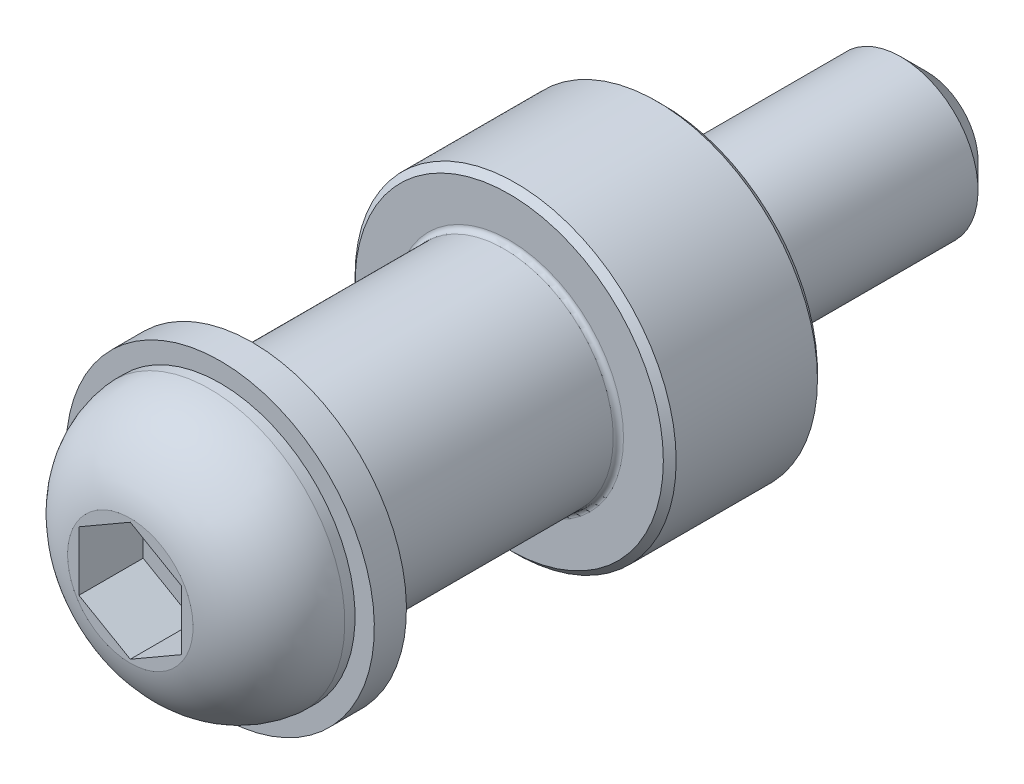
ISO-10303-21;
HEADER;
FILE_DESCRIPTION(('STEP AP214'),'2;1');
FILE_NAME('part.step','',(''),(''),'','','');
FILE_SCHEMA(('AUTOMOTIVE_DESIGN { 1 0 10303 214 1 1 1 1 }'));
ENDSEC;
DATA;
#1=APPLICATION_CONTEXT('core data for automotive mechanical design processes');
#2=APPLICATION_PROTOCOL_DEFINITION('international standard','automotive_design',2000,#1);
#3=PRODUCT_CONTEXT('',#1,'mechanical');
#4=PRODUCT('Part','Part','',(#3));
#5=PRODUCT_RELATED_PRODUCT_CATEGORY('part','',(#4));
#6=PRODUCT_DEFINITION_FORMATION('','',#4);
#7=PRODUCT_DEFINITION_CONTEXT('part definition',#1,'design');
#8=PRODUCT_DEFINITION('design','',#6,#7);
#9=PRODUCT_DEFINITION_SHAPE('','',#8);
#10=(LENGTH_UNIT() NAMED_UNIT(*) SI_UNIT(.MILLI.,.METRE.));
#11=(NAMED_UNIT(*) PLANE_ANGLE_UNIT() SI_UNIT($,.RADIAN.));
#12=(NAMED_UNIT(*) SI_UNIT($,.STERADIAN.) SOLID_ANGLE_UNIT());
#13=UNCERTAINTY_MEASURE_WITH_UNIT(LENGTH_MEASURE(1.E-05),#10,'distance_accuracy_value','');
#14=(GEOMETRIC_REPRESENTATION_CONTEXT(3) GLOBAL_UNCERTAINTY_ASSIGNED_CONTEXT((#13)) GLOBAL_UNIT_ASSIGNED_CONTEXT((#10,
#11,#12)) REPRESENTATION_CONTEXT('',''));
#15=CARTESIAN_POINT('',(0.,0.,0.));
#16=DIRECTION('',(0.,0.,1.));
#17=DIRECTION('',(1.,0.,0.));
#18=AXIS2_PLACEMENT_3D('',#15,#16,#17);
#19=CARTESIAN_POINT('',(0.,8.5,31.5));
#20=DIRECTION('',(0.,0.,1.));
#21=DIRECTION('',(1.,0.,0.));
#22=AXIS2_PLACEMENT_3D('',#19,#20,#21);
#23=PLANE('',#22);
#24=CARTESIAN_POINT('',(0.,0.,31.5));
#25=DIRECTION('',(0.,0.,1.));
#26=DIRECTION('',(1.,0.,0.));
#27=AXIS2_PLACEMENT_3D('',#24,#25,#26);
#28=CIRCLE('',#27,8.);
#29=CARTESIAN_POINT('',(8.,0.,31.5));
#30=VERTEX_POINT('',#29);
#31=EDGE_CURVE('E9',#30,#30,#28,.T.);
#32=ORIENTED_EDGE('',*,*,#31,.T.);
#33=EDGE_LOOP('',(#32));
#34=FACE_BOUND('',#33,.T.);
#35=CARTESIAN_POINT('',(0.,0.,31.5));
#36=DIRECTION('',(0.,0.,1.));
#37=DIRECTION('',(1.,0.,0.));
#38=AXIS2_PLACEMENT_3D('',#35,#36,#37);
#39=CIRCLE('',#38,6.);
#40=CARTESIAN_POINT('',(6.,0.,31.5));
#41=VERTEX_POINT('',#40);
#42=EDGE_CURVE('E142',#41,#41,#39,.F.);
#43=ORIENTED_EDGE('',*,*,#42,.T.);
#44=EDGE_LOOP('',(#43));
#45=FACE_BOUND('',#44,.T.);
#46=ADVANCED_FACE('F14',(#34,#45),#23,.T.);
#47=CARTESIAN_POINT('',(0.,0.,0.));
#48=DIRECTION('',(0.,0.,-1.));
#49=DIRECTION('',(-1.,0.,0.));
#50=AXIS2_PLACEMENT_3D('',#47,#48,#49);
#51=CYLINDRICAL_SURFACE('',#50,8.5);
#52=CARTESIAN_POINT('',(0.,0.,31.));
#53=DIRECTION('',(0.,0.,1.));
#54=DIRECTION('',(1.,0.,0.));
#55=AXIS2_PLACEMENT_3D('',#52,#53,#54);
#56=CIRCLE('',#55,8.5);
#57=CARTESIAN_POINT('',(8.5,0.,31.));
#58=VERTEX_POINT('',#57);
#59=EDGE_CURVE('E23',#58,#58,#56,.F.);
#60=ORIENTED_EDGE('',*,*,#59,.T.);
#61=EDGE_LOOP('',(#60));
#62=FACE_BOUND('',#61,.T.);
#63=CARTESIAN_POINT('',(0.,0.,12.4));
#64=DIRECTION('',(0.,0.,1.));
#65=DIRECTION('',(1.,0.,0.));
#66=AXIS2_PLACEMENT_3D('',#63,#64,#65);
#67=CIRCLE('',#66,8.5);
#68=CARTESIAN_POINT('',(8.5,0.,12.4));
#69=VERTEX_POINT('',#68);
#70=EDGE_CURVE('E152',#69,#69,#67,.T.);
#71=ORIENTED_EDGE('',*,*,#70,.T.);
#72=EDGE_LOOP('',(#71));
#73=FACE_BOUND('',#72,.T.);
#74=ADVANCED_FACE('F239',(#62,#73),#51,.T.);
#75=CARTESIAN_POINT('',(0.,12.5,12.));
#76=DIRECTION('',(0.,0.,1.));
#77=DIRECTION('',(1.,0.,0.));
#78=AXIS2_PLACEMENT_3D('',#75,#76,#77);
#79=PLANE('',#78);
#80=CARTESIAN_POINT('',(0.,0.,12.));
#81=DIRECTION('',(0.,0.,1.));
#82=DIRECTION('',(1.,0.,0.));
#83=AXIS2_PLACEMENT_3D('',#80,#81,#82);
#84=CIRCLE('',#83,12.);
#85=CARTESIAN_POINT('',(12.,0.,12.));
#86=VERTEX_POINT('',#85);
#87=EDGE_CURVE('E164',#86,#86,#84,.T.);
#88=ORIENTED_EDGE('',*,*,#87,.T.);
#89=EDGE_LOOP('',(#88));
#90=FACE_BOUND('',#89,.T.);
#91=CARTESIAN_POINT('',(0.,0.,12.));
#92=DIRECTION('',(0.,0.,1.));
#93=DIRECTION('',(1.,0.,0.));
#94=AXIS2_PLACEMENT_3D('',#91,#92,#93);
#95=CIRCLE('',#94,8.9);
#96=CARTESIAN_POINT('',(8.9,0.,12.));
#97=VERTEX_POINT('',#96);
#98=EDGE_CURVE('E147',#97,#97,#95,.F.);
#99=ORIENTED_EDGE('',*,*,#98,.T.);
#100=EDGE_LOOP('',(#99));
#101=FACE_BOUND('',#100,.T.);
#102=ADVANCED_FACE('F243',(#90,#101),#79,.T.);
#103=CARTESIAN_POINT('',(0.,0.,0.));
#104=DIRECTION('',(0.,0.,-1.));
#105=DIRECTION('',(-1.,0.,0.));
#106=AXIS2_PLACEMENT_3D('',#103,#104,#105);
#107=CYLINDRICAL_SURFACE('',#106,12.5);
#108=CARTESIAN_POINT('',(0.,0.,0.5));
#109=DIRECTION('',(0.,0.,-1.));
#110=DIRECTION('',(-1.,0.,0.));
#111=AXIS2_PLACEMENT_3D('',#108,#109,#110);
#112=CIRCLE('',#111,12.5);
#113=CARTESIAN_POINT('',(-12.5,0.,0.5));
#114=VERTEX_POINT('',#113);
#115=EDGE_CURVE('E161',#114,#114,#112,.F.);
#116=ORIENTED_EDGE('',*,*,#115,.T.);
#117=EDGE_LOOP('',(#116));
#118=FACE_BOUND('',#117,.T.);
#119=CARTESIAN_POINT('',(0.,0.,11.5));
#120=DIRECTION('',(0.,0.,1.));
#121=DIRECTION('',(1.,0.,0.));
#122=AXIS2_PLACEMENT_3D('',#119,#120,#121);
#123=CIRCLE('',#122,12.5);
#124=CARTESIAN_POINT('',(12.5,0.,11.5));
#125=VERTEX_POINT('',#124);
#126=EDGE_CURVE('E158',#125,#125,#123,.F.);
#127=ORIENTED_EDGE('',*,*,#126,.T.);
#128=EDGE_LOOP('',(#127));
#129=FACE_BOUND('',#128,.T.);
#130=ADVANCED_FACE('F247',(#118,#129),#107,.T.);
#131=CARTESIAN_POINT('',(0.,6.2,0.));
#132=DIRECTION('',(0.,0.,-1.));
#133=DIRECTION('',(-1.,0.,0.));
#134=AXIS2_PLACEMENT_3D('',#131,#132,#133);
#135=PLANE('',#134);
#136=CARTESIAN_POINT('',(0.,0.,0.));
#137=DIRECTION('',(0.,0.,-1.));
#138=DIRECTION('',(-1.,0.,0.));
#139=AXIS2_PLACEMENT_3D('',#136,#137,#138);
#140=CIRCLE('',#139,12.);
#141=CARTESIAN_POINT('',(-12.,0.,0.));
#142=VERTEX_POINT('',#141);
#143=EDGE_CURVE('E155',#142,#142,#140,.T.);
#144=ORIENTED_EDGE('',*,*,#143,.T.);
#145=EDGE_LOOP('',(#144));
#146=FACE_BOUND('',#145,.T.);
#147=CARTESIAN_POINT('',(0.,0.,0.));
#148=DIRECTION('',(0.,0.,-1.));
#149=DIRECTION('',(-1.,0.,0.));
#150=AXIS2_PLACEMENT_3D('',#147,#148,#149);
#151=CIRCLE('',#150,6.);
#152=CARTESIAN_POINT('',(-6.,0.,0.));
#153=VERTEX_POINT('',#152);
#154=EDGE_CURVE('E138',#153,#153,#151,.T.);
#155=ORIENTED_EDGE('',*,*,#154,.F.);
#156=EDGE_LOOP('',(#155));
#157=FACE_BOUND('',#156,.T.);
#158=ADVANCED_FACE('F235',(#146,#157),#135,.T.);
#159=CARTESIAN_POINT('',(0.,0.,12.4));
#160=DIRECTION('',(0.,0.,1.));
#161=DIRECTION('',(1.,0.,0.));
#162=AXIS2_PLACEMENT_3D('',#159,#160,#161);
#163=TOROIDAL_SURFACE('',#162,8.9,0.4);
#164=ORIENTED_EDGE('',*,*,#70,.F.);
#165=EDGE_LOOP('',(#164));
#166=FACE_BOUND('',#165,.T.);
#167=ORIENTED_EDGE('',*,*,#98,.F.);
#168=EDGE_LOOP('',(#167));
#169=FACE_BOUND('',#168,.T.);
#170=ADVANCED_FACE('F231',(#166,#169),#163,.F.);
#171=CARTESIAN_POINT('',(0.,0.,0.));
#172=DIRECTION('',(0.,0.,1.));
#173=DIRECTION('',(1.,0.,0.));
#174=AXIS2_PLACEMENT_3D('',#171,#172,#173);
#175=CONICAL_SURFACE('',#174,12.,0.785398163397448);
#176=ORIENTED_EDGE('',*,*,#115,.F.);
#177=EDGE_LOOP('',(#176));
#178=FACE_BOUND('',#177,.T.);
#179=ORIENTED_EDGE('',*,*,#143,.F.);
#180=EDGE_LOOP('',(#179));
#181=FACE_BOUND('',#180,.T.);
#182=ADVANCED_FACE('F227',(#178,#181),#175,.T.);
#183=CARTESIAN_POINT('',(0.,0.,11.5));
#184=DIRECTION('',(0.,0.,-1.));
#185=DIRECTION('',(-1.,0.,0.));
#186=AXIS2_PLACEMENT_3D('',#183,#184,#185);
#187=CONICAL_SURFACE('',#186,12.5,0.785398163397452);
#188=ORIENTED_EDGE('',*,*,#87,.F.);
#189=EDGE_LOOP('',(#188));
#190=FACE_BOUND('',#189,.T.);
#191=ORIENTED_EDGE('',*,*,#126,.F.);
#192=EDGE_LOOP('',(#191));
#193=FACE_BOUND('',#192,.T.);
#194=ADVANCED_FACE('F202',(#190,#193),#187,.T.);
#195=CARTESIAN_POINT('',(0.,0.,31.));
#196=DIRECTION('',(0.,0.,-1.));
#197=DIRECTION('',(-1.,0.,0.));
#198=AXIS2_PLACEMENT_3D('',#195,#196,#197);
#199=CONICAL_SURFACE('',#198,8.5,0.785398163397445);
#200=ORIENTED_EDGE('',*,*,#31,.F.);
#201=EDGE_LOOP('',(#200));
#202=FACE_BOUND('',#201,.T.);
#203=ORIENTED_EDGE('',*,*,#59,.F.);
#204=EDGE_LOOP('',(#203));
#205=FACE_BOUND('',#204,.T.);
#206=ADVANCED_FACE('F182',(#202,#205),#199,.T.);
#207=CARTESIAN_POINT('',(0.,0.,-20.5));
#208=DIRECTION('',(0.,0.,-1.));
#209=DIRECTION('',(0.,1.,0.));
#210=AXIS2_PLACEMENT_3D('',#207,#208,#209);
#211=PLANE('',#210);
#212=CARTESIAN_POINT('',(0.,0.,-20.5));
#213=DIRECTION('',(0.,0.,-1.));
#214=DIRECTION('',(0.,1.,0.));
#215=AXIS2_PLACEMENT_3D('',#212,#213,#214);
#216=CIRCLE('',#215,4.);
#217=CARTESIAN_POINT('',(0.,4.,-20.5));
#218=VERTEX_POINT('',#217);
#219=EDGE_CURVE('E133',#218,#218,#216,.T.);
#220=ORIENTED_EDGE('',*,*,#219,.T.);
#221=EDGE_LOOP('',(#220));
#222=FACE_BOUND('',#221,.T.);
#223=ADVANCED_FACE('F201',(#222),#211,.T.);
#224=CARTESIAN_POINT('',(0.,0.,-20.5));
#225=DIRECTION('',(0.,0.,1.));
#226=DIRECTION('',(0.,-1.,0.));
#227=AXIS2_PLACEMENT_3D('',#224,#225,#226);
#228=CONICAL_SURFACE('',#227,4.,0.785398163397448);
#229=CARTESIAN_POINT('',(0.,0.,-18.5));
#230=DIRECTION('',(0.,0.,-1.));
#231=DIRECTION('',(0.,1.,0.));
#232=AXIS2_PLACEMENT_3D('',#229,#230,#231);
#233=CIRCLE('',#232,6.);
#234=CARTESIAN_POINT('',(0.,6.,-18.5));
#235=VERTEX_POINT('',#234);
#236=EDGE_CURVE('E18',#235,#235,#233,.F.);
#237=ORIENTED_EDGE('',*,*,#236,.F.);
#238=EDGE_LOOP('',(#237));
#239=FACE_BOUND('',#238,.T.);
#240=ORIENTED_EDGE('',*,*,#219,.F.);
#241=EDGE_LOOP('',(#240));
#242=FACE_BOUND('',#241,.T.);
#243=ADVANCED_FACE('F16',(#239,#242),#228,.T.);
#244=CARTESIAN_POINT('',(0.,0.,49.5));
#245=DIRECTION('',(0.,0.,1.));
#246=DIRECTION('',(0.,-1.,0.));
#247=AXIS2_PLACEMENT_3D('',#244,#245,#246);
#248=CYLINDRICAL_SURFACE('',#247,6.);
#249=ORIENTED_EDGE('',*,*,#154,.T.);
#250=EDGE_LOOP('',(#249));
#251=FACE_BOUND('',#250,.T.);
#252=ORIENTED_EDGE('',*,*,#236,.T.);
#253=EDGE_LOOP('',(#252));
#254=FACE_BOUND('',#253,.T.);
#255=ADVANCED_FACE('F205',(#251,#254),#248,.T.);
#256=CARTESIAN_POINT('',(-4.,-6.92820323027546,36.5));
#257=DIRECTION('',(0.,0.,1.));
#258=DIRECTION('',(1.,0.,0.));
#259=AXIS2_PLACEMENT_3D('',#256,#257,#258);
#260=PLANE('',#259);
#261=DIRECTION('',(-0.86602540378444,-0.5,0.));
#262=VECTOR('',#261,1.);
#263=CARTESIAN_POINT('',(4.,-2.30940107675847,36.5));
#264=LINE('',#263,#262);
#265=CARTESIAN_POINT('',(4.,-2.30940107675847,36.5));
#266=VERTEX_POINT('',#265);
#267=CARTESIAN_POINT('',(0.,-4.61880215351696,36.5));
#268=VERTEX_POINT('',#267);
#269=EDGE_CURVE('E68',#266,#268,#264,.T.);
#270=ORIENTED_EDGE('',*,*,#269,.F.);
#271=DIRECTION('',(0.,-1.,0.));
#272=VECTOR('',#271,1.);
#273=CARTESIAN_POINT('',(4.,2.30940107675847,36.5));
#274=LINE('',#273,#272);
#275=CARTESIAN_POINT('',(4.,2.30940107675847,36.5));
#276=VERTEX_POINT('',#275);
#277=EDGE_CURVE('E115',#276,#266,#274,.T.);
#278=ORIENTED_EDGE('',*,*,#277,.F.);
#279=DIRECTION('',(-0.86602540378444,0.5,0.));
#280=VECTOR('',#279,1.);
#281=CARTESIAN_POINT('',(4.,2.30940107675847,36.5));
#282=LINE('',#281,#280);
#283=CARTESIAN_POINT('',(0.,4.61880215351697,36.5));
#284=VERTEX_POINT('',#283);
#285=EDGE_CURVE('E112',#276,#284,#282,.T.);
#286=ORIENTED_EDGE('',*,*,#285,.T.);
#287=DIRECTION('',(0.86602540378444,0.5,0.));
#288=VECTOR('',#287,1.);
#289=CARTESIAN_POINT('',(-4.,2.30940107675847,36.5));
#290=LINE('',#289,#288);
#291=CARTESIAN_POINT('',(-4.,2.30940107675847,36.5));
#292=VERTEX_POINT('',#291);
#293=EDGE_CURVE('E109',#292,#284,#290,.T.);
#294=ORIENTED_EDGE('',*,*,#293,.F.);
#295=DIRECTION('',(0.,-1.,0.));
#296=VECTOR('',#295,1.);
#297=CARTESIAN_POINT('',(-4.,2.30940107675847,36.5));
#298=LINE('',#297,#296);
#299=CARTESIAN_POINT('',(-4.,-2.30940107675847,36.5));
#300=VERTEX_POINT('',#299);
#301=EDGE_CURVE('E106',#292,#300,#298,.T.);
#302=ORIENTED_EDGE('',*,*,#301,.T.);
#303=DIRECTION('',(0.86602540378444,-0.5,0.));
#304=VECTOR('',#303,1.);
#305=CARTESIAN_POINT('',(-4.,-2.30940107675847,36.5));
#306=LINE('',#305,#304);
#307=EDGE_CURVE('E104',#300,#268,#306,.T.);
#308=ORIENTED_EDGE('',*,*,#307,.T.);
#309=EDGE_LOOP('',(#270,#278,#286,#294,#302,#308));
#310=FACE_BOUND('',#309,.T.);
#311=ADVANCED_FACE('F207',(#310),#260,.T.);
#312=CARTESIAN_POINT('',(4.,2.30940107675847,36.5));
#313=DIRECTION('',(0.5,0.86602540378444,0.));
#314=DIRECTION('',(-0.86602540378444,0.5,0.));
#315=AXIS2_PLACEMENT_3D('',#312,#313,#314);
#316=PLANE('',#315);
#317=DIRECTION('',(0.,0.,1.));
#318=VECTOR('',#317,1.);
#319=CARTESIAN_POINT('',(4.,2.30940107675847,36.5));
#320=LINE('',#319,#318);
#321=CARTESIAN_POINT('',(4.,2.30940107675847,41.5));
#322=VERTEX_POINT('',#321);
#323=EDGE_CURVE('E119',#276,#322,#320,.T.);
#324=ORIENTED_EDGE('',*,*,#323,.T.);
#325=DIRECTION('',(-0.86602540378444,0.5,0.));
#326=VECTOR('',#325,1.);
#327=CARTESIAN_POINT('',(4.,2.30940107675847,41.5));
#328=LINE('',#327,#326);
#329=CARTESIAN_POINT('',(0.,4.61880215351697,41.5));
#330=VERTEX_POINT('',#329);
#331=EDGE_CURVE('E99',#322,#330,#328,.T.);
#332=ORIENTED_EDGE('',*,*,#331,.T.);
#333=DIRECTION('',(0.,0.,1.));
#334=VECTOR('',#333,1.);
#335=CARTESIAN_POINT('',(0.,4.61880215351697,36.5));
#336=LINE('',#335,#334);
#337=EDGE_CURVE('E121',#284,#330,#336,.T.);
#338=ORIENTED_EDGE('',*,*,#337,.F.);
#339=ORIENTED_EDGE('',*,*,#285,.F.);
#340=EDGE_LOOP('',(#324,#332,#338,#339));
#341=FACE_BOUND('',#340,.T.);
#342=ADVANCED_FACE('F213',(#341),#316,.F.);
#343=CARTESIAN_POINT('',(-4.,2.30940107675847,36.5));
#344=DIRECTION('',(0.5,-0.86602540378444,0.));
#345=DIRECTION('',(0.86602540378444,0.5,0.));
#346=AXIS2_PLACEMENT_3D('',#343,#344,#345);
#347=PLANE('',#346);
#348=ORIENTED_EDGE('',*,*,#337,.T.);
#349=DIRECTION('',(0.86602540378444,0.5,0.));
#350=VECTOR('',#349,1.);
#351=CARTESIAN_POINT('',(-4.,2.30940107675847,41.5));
#352=LINE('',#351,#350);
#353=CARTESIAN_POINT('',(-4.,2.30940107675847,41.5));
#354=VERTEX_POINT('',#353);
#355=EDGE_CURVE('E96',#354,#330,#352,.T.);
#356=ORIENTED_EDGE('',*,*,#355,.F.);
#357=DIRECTION('',(0.,0.,1.));
#358=VECTOR('',#357,1.);
#359=CARTESIAN_POINT('',(-4.,2.30940107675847,36.5));
#360=LINE('',#359,#358);
#361=EDGE_CURVE('E123',#292,#354,#360,.T.);
#362=ORIENTED_EDGE('',*,*,#361,.F.);
#363=ORIENTED_EDGE('',*,*,#293,.T.);
#364=EDGE_LOOP('',(#348,#356,#362,#363));
#365=FACE_BOUND('',#364,.T.);
#366=ADVANCED_FACE('F383',(#365),#347,.T.);
#367=CARTESIAN_POINT('',(-4.,2.30940107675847,36.5));
#368=DIRECTION('',(-1.,0.,0.));
#369=DIRECTION('',(0.,-1.,0.));
#370=AXIS2_PLACEMENT_3D('',#367,#368,#369);
#371=PLANE('',#370);
#372=ORIENTED_EDGE('',*,*,#361,.T.);
#373=DIRECTION('',(0.,-1.,0.));
#374=VECTOR('',#373,1.);
#375=CARTESIAN_POINT('',(-4.,2.30940107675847,41.5));
#376=LINE('',#375,#374);
#377=CARTESIAN_POINT('',(-4.,-2.30940107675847,41.5));
#378=VERTEX_POINT('',#377);
#379=EDGE_CURVE('E81',#354,#378,#376,.T.);
#380=ORIENTED_EDGE('',*,*,#379,.T.);
#381=DIRECTION('',(0.,0.,1.));
#382=VECTOR('',#381,1.);
#383=CARTESIAN_POINT('',(-4.,-2.30940107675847,36.5));
#384=LINE('',#383,#382);
#385=EDGE_CURVE('E73',#300,#378,#384,.T.);
#386=ORIENTED_EDGE('',*,*,#385,.F.);
#387=ORIENTED_EDGE('',*,*,#301,.F.);
#388=EDGE_LOOP('',(#372,#380,#386,#387));
#389=FACE_BOUND('',#388,.T.);
#390=ADVANCED_FACE('F375',(#389),#371,.F.);
#391=CARTESIAN_POINT('',(-4.,-2.30940107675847,36.5));
#392=DIRECTION('',(-0.5,-0.86602540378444,0.));
#393=DIRECTION('',(0.86602540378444,-0.5,0.));
#394=AXIS2_PLACEMENT_3D('',#391,#392,#393);
#395=PLANE('',#394);
#396=ORIENTED_EDGE('',*,*,#385,.T.);
#397=DIRECTION('',(0.86602540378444,-0.5,0.));
#398=VECTOR('',#397,1.);
#399=CARTESIAN_POINT('',(-4.,-2.30940107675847,41.5));
#400=LINE('',#399,#398);
#401=CARTESIAN_POINT('',(0.,-4.61880215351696,41.5));
#402=VERTEX_POINT('',#401);
#403=EDGE_CURVE('E76',#378,#402,#400,.T.);
#404=ORIENTED_EDGE('',*,*,#403,.T.);
#405=DIRECTION('',(0.,0.,1.));
#406=VECTOR('',#405,1.);
#407=CARTESIAN_POINT('',(0.,-4.61880215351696,36.5));
#408=LINE('',#407,#406);
#409=EDGE_CURVE('E65',#268,#402,#408,.T.);
#410=ORIENTED_EDGE('',*,*,#409,.F.);
#411=ORIENTED_EDGE('',*,*,#307,.F.);
#412=EDGE_LOOP('',(#396,#404,#410,#411));
#413=FACE_BOUND('',#412,.T.);
#414=ADVANCED_FACE('F77',(#413),#395,.F.);
#415=CARTESIAN_POINT('',(4.,-2.30940107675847,36.5));
#416=DIRECTION('',(-0.5,0.86602540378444,0.));
#417=DIRECTION('',(-0.86602540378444,-0.5,0.));
#418=AXIS2_PLACEMENT_3D('',#415,#416,#417);
#419=PLANE('',#418);
#420=ORIENTED_EDGE('',*,*,#409,.T.);
#421=DIRECTION('',(-0.86602540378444,-0.5,0.));
#422=VECTOR('',#421,1.);
#423=CARTESIAN_POINT('',(4.,-2.30940107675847,41.5));
#424=LINE('',#423,#422);
#425=CARTESIAN_POINT('',(4.,-2.30940107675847,41.5));
#426=VERTEX_POINT('',#425);
#427=EDGE_CURVE('E31',#426,#402,#424,.T.);
#428=ORIENTED_EDGE('',*,*,#427,.F.);
#429=DIRECTION('',(0.,0.,1.));
#430=VECTOR('',#429,1.);
#431=CARTESIAN_POINT('',(4.,-2.30940107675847,36.5));
#432=LINE('',#431,#430);
#433=EDGE_CURVE('E35',#266,#426,#432,.T.);
#434=ORIENTED_EDGE('',*,*,#433,.F.);
#435=ORIENTED_EDGE('',*,*,#269,.T.);
#436=EDGE_LOOP('',(#420,#428,#434,#435));
#437=FACE_BOUND('',#436,.T.);
#438=ADVANCED_FACE('F67',(#437),#419,.T.);
#439=CARTESIAN_POINT('',(4.,2.30940107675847,36.5));
#440=DIRECTION('',(-1.,0.,0.));
#441=DIRECTION('',(0.,-1.,0.));
#442=AXIS2_PLACEMENT_3D('',#439,#440,#441);
#443=PLANE('',#442);
#444=ORIENTED_EDGE('',*,*,#277,.T.);
#445=ORIENTED_EDGE('',*,*,#433,.T.);
#446=DIRECTION('',(0.,-1.,0.));
#447=VECTOR('',#446,1.);
#448=CARTESIAN_POINT('',(4.,2.30940107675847,41.5));
#449=LINE('',#448,#447);
#450=EDGE_CURVE('E87',#322,#426,#449,.T.);
#451=ORIENTED_EDGE('',*,*,#450,.F.);
#452=ORIENTED_EDGE('',*,*,#323,.F.);
#453=EDGE_LOOP('',(#444,#445,#451,#452));
#454=FACE_BOUND('',#453,.T.);
#455=ADVANCED_FACE('F191',(#454),#443,.T.);
#456=CARTESIAN_POINT('',(0.,0.,41.5));
#457=DIRECTION('',(0.,0.,1.));
#458=DIRECTION('',(0.,-1.,0.));
#459=AXIS2_PLACEMENT_3D('',#456,#457,#458);
#460=PLANE('',#459);
#461=CARTESIAN_POINT('',(0.,0.,41.5));
#462=DIRECTION('',(0.,0.,1.));
#463=DIRECTION('',(0.,-1.,0.));
#464=AXIS2_PLACEMENT_3D('',#461,#462,#463);
#465=CIRCLE('',#464,4.88468858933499);
#466=CARTESIAN_POINT('',(0.,-4.88468858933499,41.5));
#467=VERTEX_POINT('',#466);
#468=EDGE_CURVE('E72',#467,#467,#465,.T.);
#469=ORIENTED_EDGE('',*,*,#468,.T.);
#470=EDGE_LOOP('',(#469));
#471=FACE_BOUND('',#470,.T.);
#472=ORIENTED_EDGE('',*,*,#450,.T.);
#473=ORIENTED_EDGE('',*,*,#427,.T.);
#474=ORIENTED_EDGE('',*,*,#403,.F.);
#475=ORIENTED_EDGE('',*,*,#379,.F.);
#476=ORIENTED_EDGE('',*,*,#355,.T.);
#477=ORIENTED_EDGE('',*,*,#331,.F.);
#478=EDGE_LOOP('',(#472,#473,#474,#475,#476,#477));
#479=FACE_BOUND('',#478,.T.);
#480=ADVANCED_FACE('F84',(#471,#479),#460,.T.);
#481=CARTESIAN_POINT('',(0.,0.,34.6319507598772));
#482=DIRECTION('',(0.,0.,1.));
#483=DIRECTION('',(0.,-1.,0.));
#484=AXIS2_PLACEMENT_3D('',#481,#482,#483);
#485=DEGENERATE_TOROIDAL_SURFACE('',#484,3.5319507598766,6.99999999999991,.T.);
#486=ORIENTED_EDGE('',*,*,#468,.F.);
#487=EDGE_LOOP('',(#486));
#488=FACE_BOUND('',#487,.T.);
#489=CARTESIAN_POINT('',(0.,0.,35.2999999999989));
#490=DIRECTION('',(0.,0.,1.));
#491=DIRECTION('',(0.,-1.,0.));
#492=AXIS2_PLACEMENT_3D('',#489,#490,#491);
#493=CIRCLE('',#492,10.4999999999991);
#494=CARTESIAN_POINT('',(0.,-10.4999999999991,35.2999999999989));
#495=VERTEX_POINT('',#494);
#496=EDGE_CURVE('E128',#495,#495,#493,.T.);
#497=ORIENTED_EDGE('',*,*,#496,.T.);
#498=EDGE_LOOP('',(#497));
#499=FACE_BOUND('',#498,.T.);
#500=ADVANCED_FACE('F192',(#488,#499),#485,.T.);
#501=CARTESIAN_POINT('',(0.,0.,49.5));
#502=DIRECTION('',(0.,0.,1.));
#503=DIRECTION('',(0.,-1.,0.));
#504=AXIS2_PLACEMENT_3D('',#501,#502,#503);
#505=CYLINDRICAL_SURFACE('',#504,10.4999999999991);
#506=CARTESIAN_POINT('',(0.,0.,34.5));
#507=DIRECTION('',(0.,0.,-1.));
#508=DIRECTION('',(0.,1.,0.));
#509=AXIS2_PLACEMENT_3D('',#506,#507,#508);
#510=CIRCLE('',#509,10.4999999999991);
#511=CARTESIAN_POINT('',(0.,10.4999999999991,34.5));
#512=VERTEX_POINT('',#511);
#513=EDGE_CURVE('E88',#512,#512,#510,.F.);
#514=ORIENTED_EDGE('',*,*,#513,.T.);
#515=EDGE_LOOP('',(#514));
#516=FACE_BOUND('',#515,.T.);
#517=ORIENTED_EDGE('',*,*,#496,.F.);
#518=EDGE_LOOP('',(#517));
#519=FACE_BOUND('',#518,.T.);
#520=ADVANCED_FACE('F178',(#516,#519),#505,.T.);
#521=CARTESIAN_POINT('',(0.,0.,34.5));
#522=DIRECTION('',(0.,0.,-1.));
#523=DIRECTION('',(0.,1.,0.));
#524=AXIS2_PLACEMENT_3D('',#521,#522,#523);
#525=PLANE('',#524);
#526=ORIENTED_EDGE('',*,*,#513,.F.);
#527=EDGE_LOOP('',(#526));
#528=FACE_BOUND('',#527,.T.);
#529=CARTESIAN_POINT('',(0.,0.,34.5));
#530=DIRECTION('',(0.,0.,-1.));
#531=DIRECTION('',(0.,1.,0.));
#532=AXIS2_PLACEMENT_3D('',#529,#530,#531);
#533=CIRCLE('',#532,12.);
#534=CARTESIAN_POINT('',(0.,12.,34.5));
#535=VERTEX_POINT('',#534);
#536=EDGE_CURVE('E170',#535,#535,#533,.T.);
#537=ORIENTED_EDGE('',*,*,#536,.F.);
#538=EDGE_LOOP('',(#537));
#539=FACE_BOUND('',#538,.T.);
#540=ADVANCED_FACE('F176',(#528,#539),#525,.F.);
#541=CARTESIAN_POINT('',(0.,0.,32.));
#542=DIRECTION('',(0.,0.,1.));
#543=DIRECTION('',(0.,-1.,0.));
#544=AXIS2_PLACEMENT_3D('',#541,#542,#543);
#545=CYLINDRICAL_SURFACE('',#544,12.);
#546=CARTESIAN_POINT('',(0.,0.,32.));
#547=DIRECTION('',(0.,0.,-1.));
#548=DIRECTION('',(0.,1.,0.));
#549=AXIS2_PLACEMENT_3D('',#546,#547,#548);
#550=CIRCLE('',#549,12.);
#551=CARTESIAN_POINT('',(0.,12.,32.));
#552=VERTEX_POINT('',#551);
#553=EDGE_CURVE('E91',#552,#552,#550,.T.);
#554=ORIENTED_EDGE('',*,*,#553,.F.);
#555=EDGE_LOOP('',(#554));
#556=FACE_BOUND('',#555,.T.);
#557=ORIENTED_EDGE('',*,*,#536,.T.);
#558=EDGE_LOOP('',(#557));
#559=FACE_BOUND('',#558,.T.);
#560=ADVANCED_FACE('F174',(#556,#559),#545,.T.);
#561=CARTESIAN_POINT('',(0.,0.,32.));
#562=DIRECTION('',(0.,0.,-1.));
#563=DIRECTION('',(0.,1.,0.));
#564=AXIS2_PLACEMENT_3D('',#561,#562,#563);
#565=PLANE('',#564);
#566=CARTESIAN_POINT('',(0.,0.,32.));
#567=DIRECTION('',(0.,0.,-1.));
#568=DIRECTION('',(0.,1.,0.));
#569=AXIS2_PLACEMENT_3D('',#566,#567,#568);
#570=CIRCLE('',#569,6.);
#571=CARTESIAN_POINT('',(0.,6.,32.));
#572=VERTEX_POINT('',#571);
#573=EDGE_CURVE('E131',#572,#572,#570,.F.);
#574=ORIENTED_EDGE('',*,*,#573,.T.);
#575=EDGE_LOOP('',(#574));
#576=FACE_BOUND('',#575,.T.);
#577=ORIENTED_EDGE('',*,*,#553,.T.);
#578=EDGE_LOOP('',(#577));
#579=FACE_BOUND('',#578,.T.);
#580=ADVANCED_FACE('F181',(#576,#579),#565,.T.);
#581=ORIENTED_EDGE('',*,*,#42,.F.);
#582=EDGE_LOOP('',(#581));
#583=FACE_BOUND('',#582,.T.);
#584=ORIENTED_EDGE('',*,*,#573,.F.);
#585=EDGE_LOOP('',(#584));
#586=FACE_BOUND('',#585,.T.);
#587=ADVANCED_FACE('F198',(#583,#586),#248,.T.);
#588=CLOSED_SHELL('',(#46,#74,#102,#130,#158,#170,#182,#194,#206,#223,#243,#255,#311,#342,#366,
#390,#414,#438,#455,#480,#500,#520,#540,#560,#580,#587));
#589=MANIFOLD_SOLID_BREP('B1',#588);
#590=ADVANCED_BREP_SHAPE_REPRESENTATION('',(#18,#589),#14);
#591=SHAPE_DEFINITION_REPRESENTATION(#9,#590);
ENDSEC;
END-ISO-10303-21;
